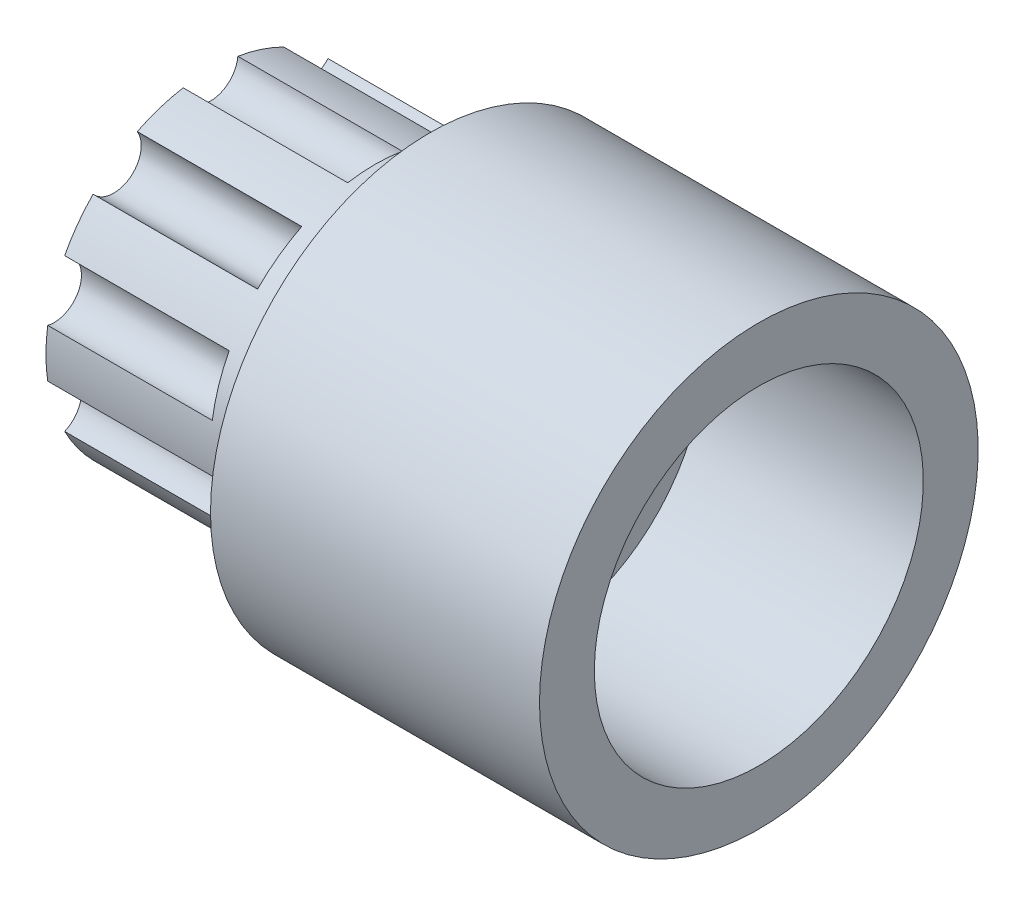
ISO-10303-21;
HEADER;
FILE_DESCRIPTION(('STEP AP214'),'2;1');
FILE_NAME('part.step','',(''),(''),'','','');
FILE_SCHEMA(('AUTOMOTIVE_DESIGN { 1 0 10303 214 1 1 1 1 }'));
ENDSEC;
DATA;
#1=APPLICATION_CONTEXT('core data for automotive mechanical design processes');
#2=APPLICATION_PROTOCOL_DEFINITION('international standard','automotive_design',2000,#1);
#3=PRODUCT_CONTEXT('',#1,'mechanical');
#4=PRODUCT('Part','Part','',(#3));
#5=PRODUCT_RELATED_PRODUCT_CATEGORY('part','',(#4));
#6=PRODUCT_DEFINITION_FORMATION('','',#4);
#7=PRODUCT_DEFINITION_CONTEXT('part definition',#1,'design');
#8=PRODUCT_DEFINITION('design','',#6,#7);
#9=PRODUCT_DEFINITION_SHAPE('','',#8);
#10=(LENGTH_UNIT() NAMED_UNIT(*) SI_UNIT(.MILLI.,.METRE.));
#11=(NAMED_UNIT(*) PLANE_ANGLE_UNIT() SI_UNIT($,.RADIAN.));
#12=(NAMED_UNIT(*) SI_UNIT($,.STERADIAN.) SOLID_ANGLE_UNIT());
#13=UNCERTAINTY_MEASURE_WITH_UNIT(LENGTH_MEASURE(1.E-05),#10,'distance_accuracy_value','');
#14=(GEOMETRIC_REPRESENTATION_CONTEXT(3) GLOBAL_UNCERTAINTY_ASSIGNED_CONTEXT((#13)) GLOBAL_UNIT_ASSIGNED_CONTEXT((#10,
#11,#12)) REPRESENTATION_CONTEXT('',''));
#15=CARTESIAN_POINT('',(0.,0.,0.));
#16=DIRECTION('',(0.,0.,1.));
#17=DIRECTION('',(1.,0.,0.));
#18=AXIS2_PLACEMENT_3D('',#15,#16,#17);
#19=CARTESIAN_POINT('',(0.,3.,0.));
#20=DIRECTION('',(-1.,0.,0.));
#21=DIRECTION('',(0.,0.,1.));
#22=AXIS2_PLACEMENT_3D('',#19,#20,#21);
#23=PLANE('',#22);
#24=CARTESIAN_POINT('',(0.,0.,0.));
#25=DIRECTION('',(-1.,0.,0.));
#26=DIRECTION('',(0.,0.,1.));
#27=AXIS2_PLACEMENT_3D('',#24,#25,#26);
#28=CIRCLE('',#27,4.);
#29=CARTESIAN_POINT('',(0.,0.,4.));
#30=VERTEX_POINT('',#29);
#31=EDGE_CURVE('E215',#30,#30,#28,.T.);
#32=ORIENTED_EDGE('',*,*,#31,.F.);
#33=EDGE_LOOP('',(#32));
#34=FACE_BOUND('',#33,.T.);
#35=CARTESIAN_POINT('',(0.,0.,0.));
#36=DIRECTION('',(-1.,0.,0.));
#37=DIRECTION('',(0.,0.,1.));
#38=AXIS2_PLACEMENT_3D('',#35,#36,#37);
#39=CIRCLE('',#38,3.);
#40=CARTESIAN_POINT('',(0.,0.,3.));
#41=VERTEX_POINT('',#40);
#42=EDGE_CURVE('E345',#41,#41,#39,.T.);
#43=ORIENTED_EDGE('',*,*,#42,.T.);
#44=EDGE_LOOP('',(#43));
#45=FACE_BOUND('',#44,.T.);
#46=ADVANCED_FACE('F44',(#34,#45),#23,.F.);
#47=CARTESIAN_POINT('',(-58.3639446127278,0.,0.));
#48=DIRECTION('',(-1.,0.,0.));
#49=DIRECTION('',(0.,0.,1.));
#50=AXIS2_PLACEMENT_3D('',#47,#48,#49);
#51=CYLINDRICAL_SURFACE('',#50,4.);
#52=CARTESIAN_POINT('',(-6.,0.,0.));
#53=DIRECTION('',(-1.,0.,0.));
#54=DIRECTION('',(0.,0.,1.));
#55=AXIS2_PLACEMENT_3D('',#52,#53,#54);
#56=CIRCLE('',#55,4.);
#57=CARTESIAN_POINT('',(-6.,0.,4.));
#58=VERTEX_POINT('',#57);
#59=EDGE_CURVE('E212',#58,#58,#56,.T.);
#60=ORIENTED_EDGE('',*,*,#59,.F.);
#61=EDGE_LOOP('',(#60));
#62=FACE_BOUND('',#61,.T.);
#63=ORIENTED_EDGE('',*,*,#31,.T.);
#64=EDGE_LOOP('',(#63));
#65=FACE_BOUND('',#64,.T.);
#66=ADVANCED_FACE('F371',(#62,#65),#51,.T.);
#67=CARTESIAN_POINT('',(-6.,4.,0.));
#68=DIRECTION('',(1.,0.,0.));
#69=DIRECTION('',(0.,0.,-1.));
#70=AXIS2_PLACEMENT_3D('',#67,#68,#69);
#71=PLANE('',#70);
#72=CARTESIAN_POINT('',(-6.,0.,0.));
#73=DIRECTION('',(-1.,0.,0.));
#74=DIRECTION('',(0.,0.,1.));
#75=AXIS2_PLACEMENT_3D('',#72,#73,#74);
#76=CIRCLE('',#75,3.);
#77=CARTESIAN_POINT('',(-6.,0.,3.));
#78=VERTEX_POINT('',#77);
#79=EDGE_CURVE('E207',#78,#78,#76,.T.);
#80=ORIENTED_EDGE('',*,*,#79,.F.);
#81=EDGE_LOOP('',(#80));
#82=FACE_BOUND('',#81,.T.);
#83=ORIENTED_EDGE('',*,*,#59,.T.);
#84=EDGE_LOOP('',(#83));
#85=FACE_BOUND('',#84,.T.);
#86=ADVANCED_FACE('F368',(#82,#85),#71,.F.);
#87=CARTESIAN_POINT('',(-58.3639446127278,0.,0.));
#88=DIRECTION('',(-1.,0.,0.));
#89=DIRECTION('',(0.,0.,1.));
#90=AXIS2_PLACEMENT_3D('',#87,#88,#89);
#91=CYLINDRICAL_SURFACE('',#90,3.);
#92=CARTESIAN_POINT('',(-9.99999999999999,0.,0.));
#93=DIRECTION('',(-1.,0.,0.));
#94=DIRECTION('',(0.,0.,1.));
#95=AXIS2_PLACEMENT_3D('',#92,#93,#94);
#96=CIRCLE('',#95,3.);
#97=CARTESIAN_POINT('',(-9.99999999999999,2.6862123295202,1.33576319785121));
#98=VERTEX_POINT('',#97);
#99=CARTESIAN_POINT('',(-9.99999999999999,2.95833333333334,0.498260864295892));
#100=VERTEX_POINT('',#99);
#101=EDGE_CURVE('E199',#98,#100,#96,.T.);
#102=ORIENTED_EDGE('',*,*,#101,.F.);
#103=DIRECTION('',(-1.,0.,0.));
#104=VECTOR('',#103,1.);
#105=CARTESIAN_POINT('',(-8.5,2.6862123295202,1.33576319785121));
#106=LINE('',#105,#104);
#107=CARTESIAN_POINT('',(-7.,2.6862123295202,1.33576319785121));
#108=VERTEX_POINT('',#107);
#109=EDGE_CURVE('E58',#98,#108,#106,.F.);
#110=ORIENTED_EDGE('',*,*,#109,.T.);
#111=CARTESIAN_POINT('',(-7.,0.,0.));
#112=DIRECTION('',(1.,0.,0.));
#113=DIRECTION('',(0.,0.,-1.));
#114=AXIS2_PLACEMENT_3D('',#111,#112,#113);
#115=CIRCLE('',#114,3.);
#116=CARTESIAN_POINT('',(-7.,2.10047155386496,2.14196621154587));
#117=VERTEX_POINT('',#116);
#118=EDGE_CURVE('E13',#108,#117,#115,.T.);
#119=ORIENTED_EDGE('',*,*,#118,.T.);
#120=DIRECTION('',(-1.,0.,0.));
#121=VECTOR('',#120,1.);
#122=CARTESIAN_POINT('',(-8.5,2.10047155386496,2.14196621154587));
#123=LINE('',#122,#121);
#124=CARTESIAN_POINT('',(-9.99999999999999,2.10047155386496,2.14196621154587));
#125=VERTEX_POINT('',#124);
#126=EDGE_CURVE('E182',#117,#125,#123,.T.);
#127=ORIENTED_EDGE('',*,*,#126,.T.);
#128=CARTESIAN_POINT('',(-9.99999999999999,1.38804951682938,2.65957111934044));
#129=VERTEX_POINT('',#128);
#130=EDGE_CURVE('E193',#129,#125,#96,.T.);
#131=ORIENTED_EDGE('',*,*,#130,.F.);
#132=DIRECTION('',(-1.,0.,0.));
#133=VECTOR('',#132,1.);
#134=CARTESIAN_POINT('',(-8.5,1.38804951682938,2.65957111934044));
#135=LINE('',#134,#133);
#136=CARTESIAN_POINT('',(-7.,1.38804951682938,2.65957111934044));
#137=VERTEX_POINT('',#136);
#138=EDGE_CURVE('E66',#129,#137,#135,.F.);
#139=ORIENTED_EDGE('',*,*,#138,.T.);
#140=CARTESIAN_POINT('',(-7.,0.,0.));
#141=DIRECTION('',(1.,0.,0.));
#142=DIRECTION('',(0.,0.,-1.));
#143=AXIS2_PLACEMENT_3D('',#140,#141,#142);
#144=CIRCLE('',#143,3.);
#145=CARTESIAN_POINT('',(-7.,0.440301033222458,2.96751326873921));
#146=VERTEX_POINT('',#145);
#147=EDGE_CURVE('E51',#137,#146,#144,.T.);
#148=ORIENTED_EDGE('',*,*,#147,.T.);
#149=DIRECTION('',(-1.,0.,0.));
#150=VECTOR('',#149,1.);
#151=CARTESIAN_POINT('',(-8.5,0.440301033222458,2.96751326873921));
#152=LINE('',#151,#150);
#153=CARTESIAN_POINT('',(-9.99999999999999,0.440301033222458,2.96751326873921));
#154=VERTEX_POINT('',#153);
#155=EDGE_CURVE('E244',#146,#154,#152,.T.);
#156=ORIENTED_EDGE('',*,*,#155,.T.);
#157=CARTESIAN_POINT('',(-9.99999999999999,-0.440301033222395,2.96751326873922));
#158=VERTEX_POINT('',#157);
#159=EDGE_CURVE('E198',#158,#154,#96,.T.);
#160=ORIENTED_EDGE('',*,*,#159,.F.);
#161=DIRECTION('',(-1.,0.,0.));
#162=VECTOR('',#161,1.);
#163=CARTESIAN_POINT('',(-8.5,-0.440301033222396,2.96751326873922));
#164=LINE('',#163,#162);
#165=CARTESIAN_POINT('',(-7.,-0.440301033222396,2.96751326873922));
#166=VERTEX_POINT('',#165);
#167=EDGE_CURVE('E264',#158,#166,#164,.F.);
#168=ORIENTED_EDGE('',*,*,#167,.T.);
#169=CARTESIAN_POINT('',(-7.,0.,0.));
#170=DIRECTION('',(1.,0.,0.));
#171=DIRECTION('',(0.,0.,-1.));
#172=AXIS2_PLACEMENT_3D('',#169,#170,#171);
#173=CIRCLE('',#172,3.);
#174=CARTESIAN_POINT('',(-7.,-1.38804951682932,2.65957111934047));
#175=VERTEX_POINT('',#174);
#176=EDGE_CURVE('E239',#166,#175,#173,.T.);
#177=ORIENTED_EDGE('',*,*,#176,.T.);
#178=DIRECTION('',(-1.,0.,0.));
#179=VECTOR('',#178,1.);
#180=CARTESIAN_POINT('',(-8.5,-1.38804951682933,2.65957111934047));
#181=LINE('',#180,#179);
#182=CARTESIAN_POINT('',(-9.99999999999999,-1.38804951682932,2.65957111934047));
#183=VERTEX_POINT('',#182);
#184=EDGE_CURVE('E261',#175,#183,#181,.T.);
#185=ORIENTED_EDGE('',*,*,#184,.T.);
#186=CARTESIAN_POINT('',(-9.99999999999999,-2.10047155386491,2.14196621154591));
#187=VERTEX_POINT('',#186);
#188=EDGE_CURVE('E201',#187,#183,#96,.T.);
#189=ORIENTED_EDGE('',*,*,#188,.F.);
#190=DIRECTION('',(-1.,0.,0.));
#191=VECTOR('',#190,1.);
#192=CARTESIAN_POINT('',(-8.5,-2.10047155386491,2.14196621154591));
#193=LINE('',#192,#191);
#194=CARTESIAN_POINT('',(-7.,-2.10047155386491,2.14196621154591));
#195=VERTEX_POINT('',#194);
#196=EDGE_CURVE('E275',#187,#195,#193,.F.);
#197=ORIENTED_EDGE('',*,*,#196,.T.);
#198=CARTESIAN_POINT('',(-7.,0.,0.));
#199=DIRECTION('',(1.,0.,0.));
#200=DIRECTION('',(0.,0.,-1.));
#201=AXIS2_PLACEMENT_3D('',#198,#199,#200);
#202=CIRCLE('',#201,3.);
#203=CARTESIAN_POINT('',(-7.,-2.68621232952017,1.33576319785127));
#204=VERTEX_POINT('',#203);
#205=EDGE_CURVE('E236',#195,#204,#202,.T.);
#206=ORIENTED_EDGE('',*,*,#205,.T.);
#207=DIRECTION('',(-1.,0.,0.));
#208=VECTOR('',#207,1.);
#209=CARTESIAN_POINT('',(-8.5,-2.68621232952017,1.33576319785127));
#210=LINE('',#209,#208);
#211=CARTESIAN_POINT('',(-9.99999999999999,-2.68621232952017,1.33576319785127));
#212=VERTEX_POINT('',#211);
#213=EDGE_CURVE('E272',#204,#212,#210,.T.);
#214=ORIENTED_EDGE('',*,*,#213,.T.);
#215=CARTESIAN_POINT('',(-9.99999999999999,-2.95833333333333,0.498260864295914));
#216=VERTEX_POINT('',#215);
#217=EDGE_CURVE('E652',#216,#212,#96,.T.);
#218=ORIENTED_EDGE('',*,*,#217,.F.);
#219=DIRECTION('',(-1.,0.,0.));
#220=VECTOR('',#219,1.);
#221=CARTESIAN_POINT('',(-8.5,-2.95833333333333,0.498260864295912));
#222=LINE('',#221,#220);
#223=CARTESIAN_POINT('',(-7.,-2.95833333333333,0.498260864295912));
#224=VERTEX_POINT('',#223);
#225=EDGE_CURVE('E286',#216,#224,#222,.F.);
#226=ORIENTED_EDGE('',*,*,#225,.T.);
#227=CARTESIAN_POINT('',(-7.,0.,0.));
#228=DIRECTION('',(1.,0.,0.));
#229=DIRECTION('',(0.,0.,-1.));
#230=AXIS2_PLACEMENT_3D('',#227,#228,#229);
#231=CIRCLE('',#230,3.);
#232=CARTESIAN_POINT('',(-7.,-2.95833333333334,-0.498260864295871));
#233=VERTEX_POINT('',#232);
#234=EDGE_CURVE('E233',#224,#233,#231,.T.);
#235=ORIENTED_EDGE('',*,*,#234,.T.);
#236=DIRECTION('',(-1.,0.,0.));
#237=VECTOR('',#236,1.);
#238=CARTESIAN_POINT('',(-8.5,-2.95833333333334,-0.498260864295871));
#239=LINE('',#238,#237);
#240=CARTESIAN_POINT('',(-9.99999999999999,-2.95833333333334,-0.498260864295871));
#241=VERTEX_POINT('',#240);
#242=EDGE_CURVE('E283',#233,#241,#239,.T.);
#243=ORIENTED_EDGE('',*,*,#242,.T.);
#244=CARTESIAN_POINT('',(-9.99999999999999,-2.68621232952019,-1.33576319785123));
#245=VERTEX_POINT('',#244);
#246=EDGE_CURVE('E648',#245,#241,#96,.T.);
#247=ORIENTED_EDGE('',*,*,#246,.F.);
#248=DIRECTION('',(-1.,0.,0.));
#249=VECTOR('',#248,1.);
#250=CARTESIAN_POINT('',(-8.5,-2.68621232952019,-1.33576319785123));
#251=LINE('',#250,#249);
#252=CARTESIAN_POINT('',(-7.,-2.68621232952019,-1.33576319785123));
#253=VERTEX_POINT('',#252);
#254=EDGE_CURVE('E297',#245,#253,#251,.F.);
#255=ORIENTED_EDGE('',*,*,#254,.T.);
#256=CARTESIAN_POINT('',(-7.,0.,0.));
#257=DIRECTION('',(1.,0.,0.));
#258=DIRECTION('',(0.,0.,-1.));
#259=AXIS2_PLACEMENT_3D('',#256,#257,#258);
#260=CIRCLE('',#259,3.);
#261=CARTESIAN_POINT('',(-7.,-2.10047155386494,-2.14196621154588));
#262=VERTEX_POINT('',#261);
#263=EDGE_CURVE('E230',#253,#262,#260,.T.);
#264=ORIENTED_EDGE('',*,*,#263,.T.);
#265=DIRECTION('',(-1.,0.,0.));
#266=VECTOR('',#265,1.);
#267=CARTESIAN_POINT('',(-8.5,-2.10047155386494,-2.14196621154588));
#268=LINE('',#267,#266);
#269=CARTESIAN_POINT('',(-9.99999999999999,-2.10047155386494,-2.14196621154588));
#270=VERTEX_POINT('',#269);
#271=EDGE_CURVE('E294',#262,#270,#268,.T.);
#272=ORIENTED_EDGE('',*,*,#271,.T.);
#273=CARTESIAN_POINT('',(-9.99999999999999,-1.38804951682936,-2.65957111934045));
#274=VERTEX_POINT('',#273);
#275=EDGE_CURVE('E644',#274,#270,#96,.T.);
#276=ORIENTED_EDGE('',*,*,#275,.F.);
#277=DIRECTION('',(-1.,0.,0.));
#278=VECTOR('',#277,1.);
#279=CARTESIAN_POINT('',(-8.5,-1.38804951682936,-2.65957111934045));
#280=LINE('',#279,#278);
#281=CARTESIAN_POINT('',(-7.,-1.38804951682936,-2.65957111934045));
#282=VERTEX_POINT('',#281);
#283=EDGE_CURVE('E308',#274,#282,#280,.F.);
#284=ORIENTED_EDGE('',*,*,#283,.T.);
#285=CARTESIAN_POINT('',(-7.,0.,0.));
#286=DIRECTION('',(1.,0.,0.));
#287=DIRECTION('',(0.,0.,-1.));
#288=AXIS2_PLACEMENT_3D('',#285,#286,#287);
#289=CIRCLE('',#288,3.);
#290=CARTESIAN_POINT('',(-7.,-0.440301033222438,-2.96751326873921));
#291=VERTEX_POINT('',#290);
#292=EDGE_CURVE('E227',#282,#291,#289,.T.);
#293=ORIENTED_EDGE('',*,*,#292,.T.);
#294=DIRECTION('',(-1.,0.,0.));
#295=VECTOR('',#294,1.);
#296=CARTESIAN_POINT('',(-8.5,-0.440301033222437,-2.96751326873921));
#297=LINE('',#296,#295);
#298=CARTESIAN_POINT('',(-9.99999999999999,-0.440301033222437,-2.96751326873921));
#299=VERTEX_POINT('',#298);
#300=EDGE_CURVE('E305',#291,#299,#297,.T.);
#301=ORIENTED_EDGE('',*,*,#300,.T.);
#302=CARTESIAN_POINT('',(-9.99999999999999,0.440301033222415,-2.96751326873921));
#303=VERTEX_POINT('',#302);
#304=EDGE_CURVE('E642',#303,#299,#96,.T.);
#305=ORIENTED_EDGE('',*,*,#304,.F.);
#306=DIRECTION('',(-1.,0.,0.));
#307=VECTOR('',#306,1.);
#308=CARTESIAN_POINT('',(-8.5,0.440301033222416,-2.96751326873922));
#309=LINE('',#308,#307);
#310=CARTESIAN_POINT('',(-7.,0.440301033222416,-2.96751326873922));
#311=VERTEX_POINT('',#310);
#312=EDGE_CURVE('E319',#303,#311,#309,.F.);
#313=ORIENTED_EDGE('',*,*,#312,.T.);
#314=CARTESIAN_POINT('',(-7.,0.,0.));
#315=DIRECTION('',(1.,0.,0.));
#316=DIRECTION('',(0.,0.,-1.));
#317=AXIS2_PLACEMENT_3D('',#314,#315,#316);
#318=CIRCLE('',#317,3.);
#319=CARTESIAN_POINT('',(-7.,1.38804951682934,-2.65957111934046));
#320=VERTEX_POINT('',#319);
#321=EDGE_CURVE('E224',#311,#320,#318,.T.);
#322=ORIENTED_EDGE('',*,*,#321,.T.);
#323=DIRECTION('',(-1.,0.,0.));
#324=VECTOR('',#323,1.);
#325=CARTESIAN_POINT('',(-8.5,1.38804951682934,-2.65957111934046));
#326=LINE('',#325,#324);
#327=CARTESIAN_POINT('',(-9.99999999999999,1.38804951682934,-2.65957111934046));
#328=VERTEX_POINT('',#327);
#329=EDGE_CURVE('E316',#320,#328,#326,.T.);
#330=ORIENTED_EDGE('',*,*,#329,.T.);
#331=CARTESIAN_POINT('',(-9.99999999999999,2.10047155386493,-2.1419662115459));
#332=VERTEX_POINT('',#331);
#333=EDGE_CURVE('E208',#332,#328,#96,.T.);
#334=ORIENTED_EDGE('',*,*,#333,.F.);
#335=DIRECTION('',(-1.,0.,0.));
#336=VECTOR('',#335,1.);
#337=CARTESIAN_POINT('',(-8.5,2.10047155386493,-2.1419662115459));
#338=LINE('',#337,#336);
#339=CARTESIAN_POINT('',(-7.,2.10047155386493,-2.1419662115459));
#340=VERTEX_POINT('',#339);
#341=EDGE_CURVE('E330',#332,#340,#338,.F.);
#342=ORIENTED_EDGE('',*,*,#341,.T.);
#343=CARTESIAN_POINT('',(-7.,0.,0.));
#344=DIRECTION('',(1.,0.,0.));
#345=DIRECTION('',(0.,0.,-1.));
#346=AXIS2_PLACEMENT_3D('',#343,#344,#345);
#347=CIRCLE('',#346,3.);
#348=CARTESIAN_POINT('',(-7.,2.68621232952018,-1.33576319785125));
#349=VERTEX_POINT('',#348);
#350=EDGE_CURVE('E221',#340,#349,#347,.T.);
#351=ORIENTED_EDGE('',*,*,#350,.T.);
#352=DIRECTION('',(-1.,0.,0.));
#353=VECTOR('',#352,1.);
#354=CARTESIAN_POINT('',(-8.5,2.68621232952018,-1.33576319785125));
#355=LINE('',#354,#353);
#356=CARTESIAN_POINT('',(-9.99999999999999,2.68621232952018,-1.33576319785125));
#357=VERTEX_POINT('',#356);
#358=EDGE_CURVE('E327',#349,#357,#355,.T.);
#359=ORIENTED_EDGE('',*,*,#358,.T.);
#360=CARTESIAN_POINT('',(-9.99999999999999,2.95833333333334,-0.498260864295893));
#361=VERTEX_POINT('',#360);
#362=EDGE_CURVE('E203',#361,#357,#96,.T.);
#363=ORIENTED_EDGE('',*,*,#362,.F.);
#364=DIRECTION('',(-1.,0.,0.));
#365=VECTOR('',#364,1.);
#366=CARTESIAN_POINT('',(-8.5,2.95833333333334,-0.498260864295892));
#367=LINE('',#366,#365);
#368=CARTESIAN_POINT('',(-7.,2.95833333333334,-0.498260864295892));
#369=VERTEX_POINT('',#368);
#370=EDGE_CURVE('E342',#361,#369,#367,.F.);
#371=ORIENTED_EDGE('',*,*,#370,.T.);
#372=CARTESIAN_POINT('',(-7.,0.,0.));
#373=DIRECTION('',(1.,0.,0.));
#374=DIRECTION('',(0.,0.,-1.));
#375=AXIS2_PLACEMENT_3D('',#372,#373,#374);
#376=CIRCLE('',#375,3.);
#377=CARTESIAN_POINT('',(-7.,2.95833333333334,0.498260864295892));
#378=VERTEX_POINT('',#377);
#379=EDGE_CURVE('E218',#369,#378,#376,.T.);
#380=ORIENTED_EDGE('',*,*,#379,.T.);
#381=DIRECTION('',(-1.,0.,0.));
#382=VECTOR('',#381,1.);
#383=CARTESIAN_POINT('',(-8.5,2.95833333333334,0.498260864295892));
#384=LINE('',#383,#382);
#385=EDGE_CURVE('E339',#378,#100,#384,.T.);
#386=ORIENTED_EDGE('',*,*,#385,.T.);
#387=EDGE_LOOP('',(#102,#110,#119,#127,#131,#139,#148,#156,#160,#168,#177,#185,#189,#197,#206,
#214,#218,#226,#235,#243,#247,#255,#264,#272,#276,#284,#293,#301,#305,#313,#322,#330,#334,#342,
#351,#359,#363,#371,#380,#386));
#388=FACE_BOUND('',#387,.T.);
#389=ORIENTED_EDGE('',*,*,#79,.T.);
#390=EDGE_LOOP('',(#389));
#391=FACE_BOUND('',#390,.T.);
#392=ADVANCED_FACE('F191',(#388,#391),#91,.T.);
#393=CARTESIAN_POINT('',(-9.99999999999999,3.,0.));
#394=DIRECTION('',(1.,0.,0.));
#395=DIRECTION('',(0.,0.,-1.));
#396=AXIS2_PLACEMENT_3D('',#393,#394,#395);
#397=PLANE('',#396);
#398=CARTESIAN_POINT('',(-9.99999999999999,0.,0.));
#399=DIRECTION('',(-1.,0.,0.));
#400=DIRECTION('',(0.,0.,1.));
#401=AXIS2_PLACEMENT_3D('',#398,#399,#400);
#402=CIRCLE('',#401,2.);
#403=CARTESIAN_POINT('',(-9.99999999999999,0.,2.));
#404=VERTEX_POINT('',#403);
#405=EDGE_CURVE('E202',#404,#404,#402,.T.);
#406=ORIENTED_EDGE('',*,*,#405,.F.);
#407=EDGE_LOOP('',(#406));
#408=FACE_BOUND('',#407,.T.);
#409=ORIENTED_EDGE('',*,*,#130,.T.);
#410=CARTESIAN_POINT('',(-9.99999999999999,2.42705098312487,1.76335575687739));
#411=DIRECTION('',(-1.,0.,0.));
#412=DIRECTION('',(0.,-0.587785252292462,0.809016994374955));
#413=AXIS2_PLACEMENT_3D('',#410,#411,#412);
#414=CIRCLE('',#413,0.5);
#415=EDGE_CURVE('E179',#98,#125,#414,.T.);
#416=ORIENTED_EDGE('',*,*,#415,.F.);
#417=ORIENTED_EDGE('',*,*,#101,.T.);
#418=CARTESIAN_POINT('',(-9.99999999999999,3.,0.));
#419=DIRECTION('',(-1.,0.,0.));
#420=DIRECTION('',(0.,0.,1.));
#421=AXIS2_PLACEMENT_3D('',#418,#419,#420);
#422=CIRCLE('',#421,0.5);
#423=EDGE_CURVE('E333',#361,#100,#422,.T.);
#424=ORIENTED_EDGE('',*,*,#423,.F.);
#425=ORIENTED_EDGE('',*,*,#362,.T.);
#426=CARTESIAN_POINT('',(-9.99999999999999,2.42705098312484,-1.76335575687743));
#427=DIRECTION('',(-1.,0.,0.));
#428=DIRECTION('',(0.,0.587785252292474,0.809016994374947));
#429=AXIS2_PLACEMENT_3D('',#426,#427,#428);
#430=CIRCLE('',#429,0.5);
#431=EDGE_CURVE('E322',#332,#357,#430,.T.);
#432=ORIENTED_EDGE('',*,*,#431,.F.);
#433=ORIENTED_EDGE('',*,*,#333,.T.);
#434=CARTESIAN_POINT('',(-9.99999999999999,0.927050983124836,-2.85316954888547));
#435=DIRECTION('',(-1.,0.,0.));
#436=DIRECTION('',(0.,0.951056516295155,0.309016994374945));
#437=AXIS2_PLACEMENT_3D('',#434,#435,#436);
#438=CIRCLE('',#437,0.5);
#439=EDGE_CURVE('E311',#303,#328,#438,.T.);
#440=ORIENTED_EDGE('',*,*,#439,.F.);
#441=ORIENTED_EDGE('',*,*,#304,.T.);
#442=CARTESIAN_POINT('',(-9.99999999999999,-0.927050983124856,-2.85316954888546));
#443=DIRECTION('',(-1.,0.,0.));
#444=DIRECTION('',(0.,0.951056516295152,-0.309016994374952));
#445=AXIS2_PLACEMENT_3D('',#442,#443,#444);
#446=CIRCLE('',#445,0.5);
#447=EDGE_CURVE('E300',#274,#299,#446,.T.);
#448=ORIENTED_EDGE('',*,*,#447,.F.);
#449=ORIENTED_EDGE('',*,*,#275,.T.);
#450=CARTESIAN_POINT('',(-9.99999999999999,-2.42705098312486,-1.76335575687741));
#451=DIRECTION('',(-1.,0.,0.));
#452=DIRECTION('',(0.,0.587785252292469,-0.809016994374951));
#453=AXIS2_PLACEMENT_3D('',#450,#451,#452);
#454=CIRCLE('',#453,0.5);
#455=EDGE_CURVE('E289',#245,#270,#454,.T.);
#456=ORIENTED_EDGE('',*,*,#455,.F.);
#457=ORIENTED_EDGE('',*,*,#246,.T.);
#458=CARTESIAN_POINT('',(-9.99999999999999,-3.,0.));
#459=DIRECTION('',(-1.,0.,0.));
#460=DIRECTION('',(0.,0.,-1.));
#461=AXIS2_PLACEMENT_3D('',#458,#459,#460);
#462=CIRCLE('',#461,0.5);
#463=EDGE_CURVE('E278',#216,#241,#462,.T.);
#464=ORIENTED_EDGE('',*,*,#463,.F.);
#465=ORIENTED_EDGE('',*,*,#217,.T.);
#466=CARTESIAN_POINT('',(-9.99999999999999,-2.42705098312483,1.76335575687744));
#467=DIRECTION('',(-1.,0.,0.));
#468=DIRECTION('',(0.,-0.58778525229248,-0.809016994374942));
#469=AXIS2_PLACEMENT_3D('',#466,#467,#468);
#470=CIRCLE('',#469,0.5);
#471=EDGE_CURVE('E267',#187,#212,#470,.T.);
#472=ORIENTED_EDGE('',*,*,#471,.F.);
#473=ORIENTED_EDGE('',*,*,#188,.T.);
#474=CARTESIAN_POINT('',(-9.99999999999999,-0.927050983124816,2.85316954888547));
#475=DIRECTION('',(-1.,0.,0.));
#476=DIRECTION('',(0.,-0.951056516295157,-0.309016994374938));
#477=AXIS2_PLACEMENT_3D('',#474,#475,#476);
#478=CIRCLE('',#477,0.5);
#479=EDGE_CURVE('E256',#158,#183,#478,.T.);
#480=ORIENTED_EDGE('',*,*,#479,.F.);
#481=ORIENTED_EDGE('',*,*,#159,.T.);
#482=CARTESIAN_POINT('',(-9.99999999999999,0.927050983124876,2.85316954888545));
#483=DIRECTION('',(-1.,0.,0.));
#484=DIRECTION('',(0.,-0.95105651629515,0.309016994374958));
#485=AXIS2_PLACEMENT_3D('',#482,#483,#484);
#486=CIRCLE('',#485,0.5);
#487=EDGE_CURVE('E197',#129,#154,#486,.T.);
#488=ORIENTED_EDGE('',*,*,#487,.F.);
#489=EDGE_LOOP('',(#409,#416,#417,#424,#425,#432,#433,#440,#441,#448,#449,#456,#457,#464,#465,
#472,#473,#480,#481,#488));
#490=FACE_BOUND('',#489,.T.);
#491=ADVANCED_FACE('F195',(#408,#490),#397,.F.);
#492=CARTESIAN_POINT('',(-58.3639446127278,0.,0.));
#493=DIRECTION('',(-1.,0.,0.));
#494=DIRECTION('',(0.,0.,1.));
#495=AXIS2_PLACEMENT_3D('',#492,#493,#494);
#496=CYLINDRICAL_SURFACE('',#495,2.);
#497=CARTESIAN_POINT('',(-4.,0.,0.));
#498=DIRECTION('',(-1.,0.,0.));
#499=DIRECTION('',(0.,0.,1.));
#500=AXIS2_PLACEMENT_3D('',#497,#498,#499);
#501=CIRCLE('',#500,2.);
#502=CARTESIAN_POINT('',(-4.,0.,2.));
#503=VERTEX_POINT('',#502);
#504=EDGE_CURVE('E350',#503,#503,#501,.T.);
#505=ORIENTED_EDGE('',*,*,#504,.F.);
#506=EDGE_LOOP('',(#505));
#507=FACE_BOUND('',#506,.T.);
#508=ORIENTED_EDGE('',*,*,#405,.T.);
#509=EDGE_LOOP('',(#508));
#510=FACE_BOUND('',#509,.T.);
#511=ADVANCED_FACE('F357',(#507,#510),#496,.F.);
#512=CARTESIAN_POINT('',(-4.,2.,0.));
#513=DIRECTION('',(-1.,0.,0.));
#514=DIRECTION('',(0.,0.,1.));
#515=AXIS2_PLACEMENT_3D('',#512,#513,#514);
#516=PLANE('',#515);
#517=CARTESIAN_POINT('',(-4.,0.,0.));
#518=DIRECTION('',(-1.,0.,0.));
#519=DIRECTION('',(0.,0.,1.));
#520=AXIS2_PLACEMENT_3D('',#517,#518,#519);
#521=CIRCLE('',#520,3.);
#522=CARTESIAN_POINT('',(-4.,0.,3.));
#523=VERTEX_POINT('',#522);
#524=EDGE_CURVE('E348',#523,#523,#521,.T.);
#525=ORIENTED_EDGE('',*,*,#524,.F.);
#526=EDGE_LOOP('',(#525));
#527=FACE_BOUND('',#526,.T.);
#528=ORIENTED_EDGE('',*,*,#504,.T.);
#529=EDGE_LOOP('',(#528));
#530=FACE_BOUND('',#529,.T.);
#531=ADVANCED_FACE('F365',(#527,#530),#516,.F.);
#532=CARTESIAN_POINT('',(-58.3639446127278,0.,0.));
#533=DIRECTION('',(-1.,0.,0.));
#534=DIRECTION('',(0.,0.,1.));
#535=AXIS2_PLACEMENT_3D('',#532,#533,#534);
#536=CYLINDRICAL_SURFACE('',#535,3.);
#537=ORIENTED_EDGE('',*,*,#42,.F.);
#538=EDGE_LOOP('',(#537));
#539=FACE_BOUND('',#538,.T.);
#540=ORIENTED_EDGE('',*,*,#524,.T.);
#541=EDGE_LOOP('',(#540));
#542=FACE_BOUND('',#541,.T.);
#543=ADVANCED_FACE('F381',(#539,#542),#536,.F.);
#544=CARTESIAN_POINT('',(-7.,4.,0.));
#545=DIRECTION('',(1.,0.,0.));
#546=DIRECTION('',(0.,0.,-1.));
#547=AXIS2_PLACEMENT_3D('',#544,#545,#546);
#548=PLANE('',#547);
#549=CARTESIAN_POINT('',(-7.,3.,0.));
#550=DIRECTION('',(1.,0.,0.));
#551=DIRECTION('',(0.,0.,-1.));
#552=AXIS2_PLACEMENT_3D('',#549,#550,#551);
#553=CIRCLE('',#552,0.5);
#554=EDGE_CURVE('E336',#369,#378,#553,.F.);
#555=ORIENTED_EDGE('',*,*,#554,.T.);
#556=ORIENTED_EDGE('',*,*,#379,.F.);
#557=EDGE_LOOP('',(#555,#556));
#558=FACE_BOUND('',#557,.T.);
#559=ADVANCED_FACE('F384',(#558),#548,.F.);
#560=CARTESIAN_POINT('',(-4.5857864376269,3.,0.));
#561=DIRECTION('',(-1.,0.,0.));
#562=DIRECTION('',(0.,0.,1.));
#563=AXIS2_PLACEMENT_3D('',#560,#561,#562);
#564=CYLINDRICAL_SURFACE('',#563,0.5);
#565=ORIENTED_EDGE('',*,*,#423,.T.);
#566=ORIENTED_EDGE('',*,*,#385,.F.);
#567=ORIENTED_EDGE('',*,*,#554,.F.);
#568=ORIENTED_EDGE('',*,*,#370,.F.);
#569=EDGE_LOOP('',(#565,#566,#567,#568));
#570=FACE_BOUND('',#569,.T.);
#571=ADVANCED_FACE('F395',(#570),#564,.F.);
#572=CARTESIAN_POINT('',(-7.,4.,0.));
#573=DIRECTION('',(1.,0.,0.));
#574=DIRECTION('',(0.,0.,-1.));
#575=AXIS2_PLACEMENT_3D('',#572,#573,#574);
#576=PLANE('',#575);
#577=CARTESIAN_POINT('',(-7.,2.42705098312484,-1.76335575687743));
#578=DIRECTION('',(1.,0.,0.));
#579=DIRECTION('',(0.,0.,-1.));
#580=AXIS2_PLACEMENT_3D('',#577,#578,#579);
#581=CIRCLE('',#580,0.5);
#582=EDGE_CURVE('E324',#340,#349,#581,.F.);
#583=ORIENTED_EDGE('',*,*,#582,.T.);
#584=ORIENTED_EDGE('',*,*,#350,.F.);
#585=EDGE_LOOP('',(#583,#584));
#586=FACE_BOUND('',#585,.T.);
#587=ADVANCED_FACE('F399',(#586),#576,.F.);
#588=CARTESIAN_POINT('',(-4.5857864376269,2.42705098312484,-1.76335575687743));
#589=DIRECTION('',(-1.,0.,0.));
#590=DIRECTION('',(0.,0.,1.));
#591=AXIS2_PLACEMENT_3D('',#588,#589,#590);
#592=CYLINDRICAL_SURFACE('',#591,0.5);
#593=ORIENTED_EDGE('',*,*,#431,.T.);
#594=ORIENTED_EDGE('',*,*,#358,.F.);
#595=ORIENTED_EDGE('',*,*,#582,.F.);
#596=ORIENTED_EDGE('',*,*,#341,.F.);
#597=EDGE_LOOP('',(#593,#594,#595,#596));
#598=FACE_BOUND('',#597,.T.);
#599=ADVANCED_FACE('F403',(#598),#592,.F.);
#600=CARTESIAN_POINT('',(-7.,4.,0.));
#601=DIRECTION('',(1.,0.,0.));
#602=DIRECTION('',(0.,0.,-1.));
#603=AXIS2_PLACEMENT_3D('',#600,#601,#602);
#604=PLANE('',#603);
#605=CARTESIAN_POINT('',(-7.,0.927050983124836,-2.85316954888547));
#606=DIRECTION('',(1.,0.,0.));
#607=DIRECTION('',(0.,0.,-1.));
#608=AXIS2_PLACEMENT_3D('',#605,#606,#607);
#609=CIRCLE('',#608,0.5);
#610=EDGE_CURVE('E313',#311,#320,#609,.F.);
#611=ORIENTED_EDGE('',*,*,#610,.T.);
#612=ORIENTED_EDGE('',*,*,#321,.F.);
#613=EDGE_LOOP('',(#611,#612));
#614=FACE_BOUND('',#613,.T.);
#615=ADVANCED_FACE('F407',(#614),#604,.F.);
#616=CARTESIAN_POINT('',(-4.5857864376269,0.927050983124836,-2.85316954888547));
#617=DIRECTION('',(-1.,0.,0.));
#618=DIRECTION('',(0.,0.,1.));
#619=AXIS2_PLACEMENT_3D('',#616,#617,#618);
#620=CYLINDRICAL_SURFACE('',#619,0.5);
#621=ORIENTED_EDGE('',*,*,#439,.T.);
#622=ORIENTED_EDGE('',*,*,#329,.F.);
#623=ORIENTED_EDGE('',*,*,#610,.F.);
#624=ORIENTED_EDGE('',*,*,#312,.F.);
#625=EDGE_LOOP('',(#621,#622,#623,#624));
#626=FACE_BOUND('',#625,.T.);
#627=ADVANCED_FACE('F411',(#626),#620,.F.);
#628=CARTESIAN_POINT('',(-7.,4.,0.));
#629=DIRECTION('',(1.,0.,0.));
#630=DIRECTION('',(0.,0.,-1.));
#631=AXIS2_PLACEMENT_3D('',#628,#629,#630);
#632=PLANE('',#631);
#633=CARTESIAN_POINT('',(-7.,-0.927050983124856,-2.85316954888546));
#634=DIRECTION('',(1.,0.,0.));
#635=DIRECTION('',(0.,0.,-1.));
#636=AXIS2_PLACEMENT_3D('',#633,#634,#635);
#637=CIRCLE('',#636,0.5);
#638=EDGE_CURVE('E302',#282,#291,#637,.F.);
#639=ORIENTED_EDGE('',*,*,#638,.T.);
#640=ORIENTED_EDGE('',*,*,#292,.F.);
#641=EDGE_LOOP('',(#639,#640));
#642=FACE_BOUND('',#641,.T.);
#643=ADVANCED_FACE('F415',(#642),#632,.F.);
#644=CARTESIAN_POINT('',(-4.5857864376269,-0.927050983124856,-2.85316954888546));
#645=DIRECTION('',(-1.,0.,0.));
#646=DIRECTION('',(0.,0.,1.));
#647=AXIS2_PLACEMENT_3D('',#644,#645,#646);
#648=CYLINDRICAL_SURFACE('',#647,0.5);
#649=ORIENTED_EDGE('',*,*,#447,.T.);
#650=ORIENTED_EDGE('',*,*,#300,.F.);
#651=ORIENTED_EDGE('',*,*,#638,.F.);
#652=ORIENTED_EDGE('',*,*,#283,.F.);
#653=EDGE_LOOP('',(#649,#650,#651,#652));
#654=FACE_BOUND('',#653,.T.);
#655=ADVANCED_FACE('F419',(#654),#648,.F.);
#656=CARTESIAN_POINT('',(-7.,4.,0.));
#657=DIRECTION('',(1.,0.,0.));
#658=DIRECTION('',(0.,0.,-1.));
#659=AXIS2_PLACEMENT_3D('',#656,#657,#658);
#660=PLANE('',#659);
#661=CARTESIAN_POINT('',(-7.,-2.42705098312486,-1.76335575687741));
#662=DIRECTION('',(1.,0.,0.));
#663=DIRECTION('',(0.,0.,-1.));
#664=AXIS2_PLACEMENT_3D('',#661,#662,#663);
#665=CIRCLE('',#664,0.5);
#666=EDGE_CURVE('E291',#253,#262,#665,.F.);
#667=ORIENTED_EDGE('',*,*,#666,.T.);
#668=ORIENTED_EDGE('',*,*,#263,.F.);
#669=EDGE_LOOP('',(#667,#668));
#670=FACE_BOUND('',#669,.T.);
#671=ADVANCED_FACE('F423',(#670),#660,.F.);
#672=CARTESIAN_POINT('',(-4.5857864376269,-2.42705098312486,-1.76335575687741));
#673=DIRECTION('',(-1.,0.,0.));
#674=DIRECTION('',(0.,0.,1.));
#675=AXIS2_PLACEMENT_3D('',#672,#673,#674);
#676=CYLINDRICAL_SURFACE('',#675,0.5);
#677=ORIENTED_EDGE('',*,*,#455,.T.);
#678=ORIENTED_EDGE('',*,*,#271,.F.);
#679=ORIENTED_EDGE('',*,*,#666,.F.);
#680=ORIENTED_EDGE('',*,*,#254,.F.);
#681=EDGE_LOOP('',(#677,#678,#679,#680));
#682=FACE_BOUND('',#681,.T.);
#683=ADVANCED_FACE('F427',(#682),#676,.F.);
#684=CARTESIAN_POINT('',(-7.,4.,0.));
#685=DIRECTION('',(1.,0.,0.));
#686=DIRECTION('',(0.,0.,-1.));
#687=AXIS2_PLACEMENT_3D('',#684,#685,#686);
#688=PLANE('',#687);
#689=CARTESIAN_POINT('',(-7.,-3.,0.));
#690=DIRECTION('',(1.,0.,0.));
#691=DIRECTION('',(0.,0.,-1.));
#692=AXIS2_PLACEMENT_3D('',#689,#690,#691);
#693=CIRCLE('',#692,0.5);
#694=EDGE_CURVE('E280',#224,#233,#693,.F.);
#695=ORIENTED_EDGE('',*,*,#694,.T.);
#696=ORIENTED_EDGE('',*,*,#234,.F.);
#697=EDGE_LOOP('',(#695,#696));
#698=FACE_BOUND('',#697,.T.);
#699=ADVANCED_FACE('F431',(#698),#688,.F.);
#700=CARTESIAN_POINT('',(-4.5857864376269,-3.,0.));
#701=DIRECTION('',(-1.,0.,0.));
#702=DIRECTION('',(0.,0.,1.));
#703=AXIS2_PLACEMENT_3D('',#700,#701,#702);
#704=CYLINDRICAL_SURFACE('',#703,0.5);
#705=ORIENTED_EDGE('',*,*,#463,.T.);
#706=ORIENTED_EDGE('',*,*,#242,.F.);
#707=ORIENTED_EDGE('',*,*,#694,.F.);
#708=ORIENTED_EDGE('',*,*,#225,.F.);
#709=EDGE_LOOP('',(#705,#706,#707,#708));
#710=FACE_BOUND('',#709,.T.);
#711=ADVANCED_FACE('F435',(#710),#704,.F.);
#712=CARTESIAN_POINT('',(-7.,4.,0.));
#713=DIRECTION('',(1.,0.,0.));
#714=DIRECTION('',(0.,0.,-1.));
#715=AXIS2_PLACEMENT_3D('',#712,#713,#714);
#716=PLANE('',#715);
#717=CARTESIAN_POINT('',(-7.,-2.42705098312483,1.76335575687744));
#718=DIRECTION('',(1.,0.,0.));
#719=DIRECTION('',(0.,0.,-1.));
#720=AXIS2_PLACEMENT_3D('',#717,#718,#719);
#721=CIRCLE('',#720,0.5);
#722=EDGE_CURVE('E269',#195,#204,#721,.F.);
#723=ORIENTED_EDGE('',*,*,#722,.T.);
#724=ORIENTED_EDGE('',*,*,#205,.F.);
#725=EDGE_LOOP('',(#723,#724));
#726=FACE_BOUND('',#725,.T.);
#727=ADVANCED_FACE('F439',(#726),#716,.F.);
#728=CARTESIAN_POINT('',(-4.5857864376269,-2.42705098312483,1.76335575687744));
#729=DIRECTION('',(-1.,0.,0.));
#730=DIRECTION('',(0.,0.,1.));
#731=AXIS2_PLACEMENT_3D('',#728,#729,#730);
#732=CYLINDRICAL_SURFACE('',#731,0.5);
#733=ORIENTED_EDGE('',*,*,#471,.T.);
#734=ORIENTED_EDGE('',*,*,#213,.F.);
#735=ORIENTED_EDGE('',*,*,#722,.F.);
#736=ORIENTED_EDGE('',*,*,#196,.F.);
#737=EDGE_LOOP('',(#733,#734,#735,#736));
#738=FACE_BOUND('',#737,.T.);
#739=ADVANCED_FACE('F443',(#738),#732,.F.);
#740=CARTESIAN_POINT('',(-7.,4.,0.));
#741=DIRECTION('',(1.,0.,0.));
#742=DIRECTION('',(0.,0.,-1.));
#743=AXIS2_PLACEMENT_3D('',#740,#741,#742);
#744=PLANE('',#743);
#745=CARTESIAN_POINT('',(-7.,-0.927050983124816,2.85316954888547));
#746=DIRECTION('',(1.,0.,0.));
#747=DIRECTION('',(0.,0.,-1.));
#748=AXIS2_PLACEMENT_3D('',#745,#746,#747);
#749=CIRCLE('',#748,0.5);
#750=EDGE_CURVE('E258',#166,#175,#749,.F.);
#751=ORIENTED_EDGE('',*,*,#750,.T.);
#752=ORIENTED_EDGE('',*,*,#176,.F.);
#753=EDGE_LOOP('',(#751,#752));
#754=FACE_BOUND('',#753,.T.);
#755=ADVANCED_FACE('F447',(#754),#744,.F.);
#756=CARTESIAN_POINT('',(-4.5857864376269,-0.927050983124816,2.85316954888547));
#757=DIRECTION('',(-1.,0.,0.));
#758=DIRECTION('',(0.,0.,1.));
#759=AXIS2_PLACEMENT_3D('',#756,#757,#758);
#760=CYLINDRICAL_SURFACE('',#759,0.5);
#761=ORIENTED_EDGE('',*,*,#479,.T.);
#762=ORIENTED_EDGE('',*,*,#184,.F.);
#763=ORIENTED_EDGE('',*,*,#750,.F.);
#764=ORIENTED_EDGE('',*,*,#167,.F.);
#765=EDGE_LOOP('',(#761,#762,#763,#764));
#766=FACE_BOUND('',#765,.T.);
#767=ADVANCED_FACE('F451',(#766),#760,.F.);
#768=CARTESIAN_POINT('',(-7.,4.,0.));
#769=DIRECTION('',(1.,0.,0.));
#770=DIRECTION('',(0.,0.,-1.));
#771=AXIS2_PLACEMENT_3D('',#768,#769,#770);
#772=PLANE('',#771);
#773=CARTESIAN_POINT('',(-7.,0.927050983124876,2.85316954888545));
#774=DIRECTION('',(1.,0.,0.));
#775=DIRECTION('',(0.,0.,-1.));
#776=AXIS2_PLACEMENT_3D('',#773,#774,#775);
#777=CIRCLE('',#776,0.5);
#778=EDGE_CURVE('E248',#137,#146,#777,.F.);
#779=ORIENTED_EDGE('',*,*,#778,.T.);
#780=ORIENTED_EDGE('',*,*,#147,.F.);
#781=EDGE_LOOP('',(#779,#780));
#782=FACE_BOUND('',#781,.T.);
#783=ADVANCED_FACE('F247',(#782),#772,.F.);
#784=CARTESIAN_POINT('',(-4.5857864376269,0.927050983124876,2.85316954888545));
#785=DIRECTION('',(-1.,0.,0.));
#786=DIRECTION('',(0.,0.,1.));
#787=AXIS2_PLACEMENT_3D('',#784,#785,#786);
#788=CYLINDRICAL_SURFACE('',#787,0.5);
#789=ORIENTED_EDGE('',*,*,#487,.T.);
#790=ORIENTED_EDGE('',*,*,#155,.F.);
#791=ORIENTED_EDGE('',*,*,#778,.F.);
#792=ORIENTED_EDGE('',*,*,#138,.F.);
#793=EDGE_LOOP('',(#789,#790,#791,#792));
#794=FACE_BOUND('',#793,.T.);
#795=ADVANCED_FACE('F249',(#794),#788,.F.);
#796=CARTESIAN_POINT('',(-7.,4.,0.));
#797=DIRECTION('',(1.,0.,0.));
#798=DIRECTION('',(0.,0.,-1.));
#799=AXIS2_PLACEMENT_3D('',#796,#797,#798);
#800=PLANE('',#799);
#801=CARTESIAN_POINT('',(-7.,2.42705098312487,1.76335575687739));
#802=DIRECTION('',(1.,0.,0.));
#803=DIRECTION('',(0.,0.,-1.));
#804=AXIS2_PLACEMENT_3D('',#801,#802,#803);
#805=CIRCLE('',#804,0.5);
#806=EDGE_CURVE('E187',#108,#117,#805,.F.);
#807=ORIENTED_EDGE('',*,*,#806,.T.);
#808=ORIENTED_EDGE('',*,*,#118,.F.);
#809=EDGE_LOOP('',(#807,#808));
#810=FACE_BOUND('',#809,.T.);
#811=ADVANCED_FACE('F460',(#810),#800,.F.);
#812=CARTESIAN_POINT('',(-4.5857864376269,2.42705098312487,1.76335575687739));
#813=DIRECTION('',(-1.,0.,0.));
#814=DIRECTION('',(0.,0.,1.));
#815=AXIS2_PLACEMENT_3D('',#812,#813,#814);
#816=CYLINDRICAL_SURFACE('',#815,0.5);
#817=ORIENTED_EDGE('',*,*,#415,.T.);
#818=ORIENTED_EDGE('',*,*,#126,.F.);
#819=ORIENTED_EDGE('',*,*,#806,.F.);
#820=ORIENTED_EDGE('',*,*,#109,.F.);
#821=EDGE_LOOP('',(#817,#818,#819,#820));
#822=FACE_BOUND('',#821,.T.);
#823=ADVANCED_FACE('F181',(#822),#816,.F.);
#824=CLOSED_SHELL('',(#46,#66,#86,#392,#491,#511,#531,#543,#559,#571,#587,#599,#615,#627,#643,
#655,#671,#683,#699,#711,#727,#739,#755,#767,#783,#795,#811,#823));
#825=MANIFOLD_SOLID_BREP('B2',#824);
#826=ADVANCED_BREP_SHAPE_REPRESENTATION('',(#18,#825),#14);
#827=SHAPE_DEFINITION_REPRESENTATION(#9,#826);
ENDSEC;
END-ISO-10303-21;
